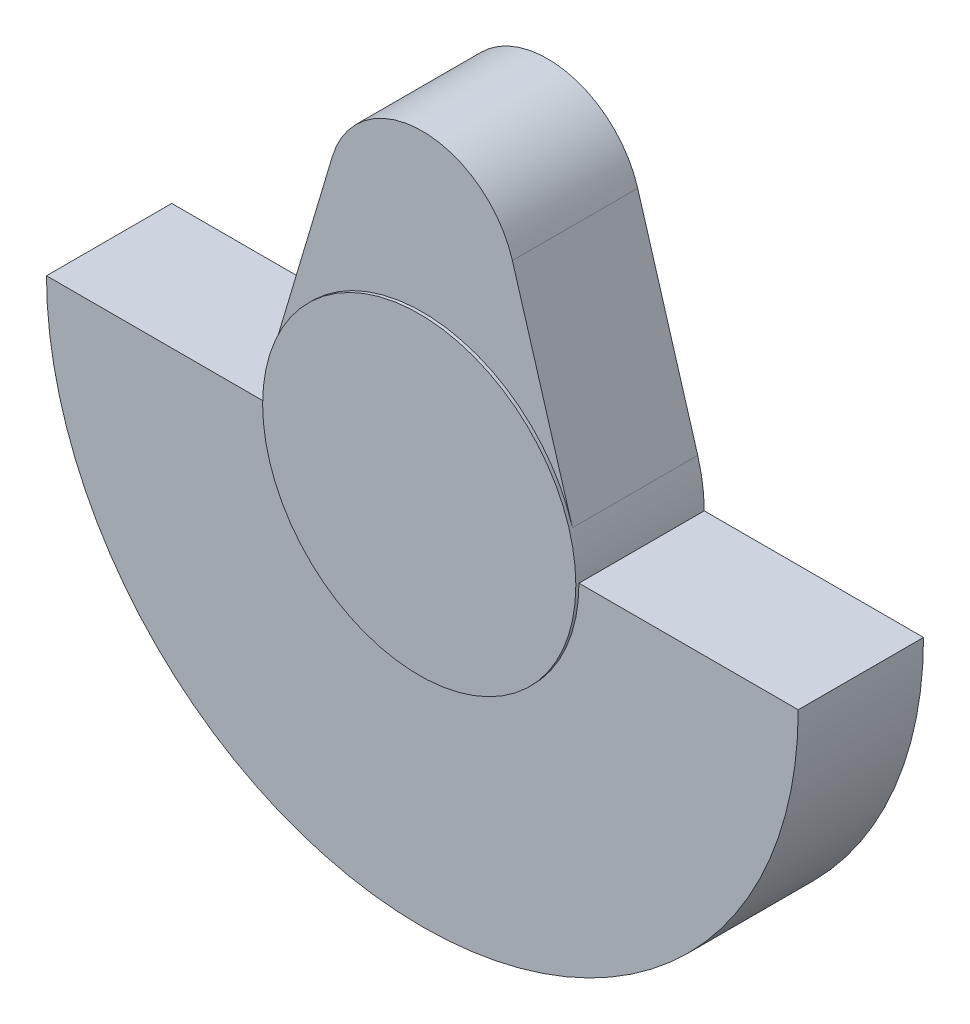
ISO-10303-21;
HEADER;
FILE_DESCRIPTION(('STEP AP214'),'2;1');
FILE_NAME('part.step','',(''),(''),'','','');
FILE_SCHEMA(('AUTOMOTIVE_DESIGN { 1 0 10303 214 1 1 1 1 }'));
ENDSEC;
DATA;
#1=APPLICATION_CONTEXT('core data for automotive mechanical design processes');
#2=APPLICATION_PROTOCOL_DEFINITION('international standard','automotive_design',2000,#1);
#3=PRODUCT_CONTEXT('',#1,'mechanical');
#4=PRODUCT('Part','Part','',(#3));
#5=PRODUCT_RELATED_PRODUCT_CATEGORY('part','',(#4));
#6=PRODUCT_DEFINITION_FORMATION('','',#4);
#7=PRODUCT_DEFINITION_CONTEXT('part definition',#1,'design');
#8=PRODUCT_DEFINITION('design','',#6,#7);
#9=PRODUCT_DEFINITION_SHAPE('','',#8);
#10=(LENGTH_UNIT() NAMED_UNIT(*) SI_UNIT(.MILLI.,.METRE.));
#11=(NAMED_UNIT(*) PLANE_ANGLE_UNIT() SI_UNIT($,.RADIAN.));
#12=(NAMED_UNIT(*) SI_UNIT($,.STERADIAN.) SOLID_ANGLE_UNIT());
#13=UNCERTAINTY_MEASURE_WITH_UNIT(LENGTH_MEASURE(1.E-05),#10,'distance_accuracy_value','');
#14=(GEOMETRIC_REPRESENTATION_CONTEXT(3) GLOBAL_UNCERTAINTY_ASSIGNED_CONTEXT((#13)) GLOBAL_UNIT_ASSIGNED_CONTEXT((#10,
#11,#12)) REPRESENTATION_CONTEXT('',''));
#15=CARTESIAN_POINT('',(0.,0.,0.));
#16=DIRECTION('',(0.,0.,1.));
#17=DIRECTION('',(1.,0.,0.));
#18=AXIS2_PLACEMENT_3D('',#15,#16,#17);
#19=CARTESIAN_POINT('',(0.,0.,-40.));
#20=DIRECTION('',(0.,0.,1.));
#21=DIRECTION('',(1.,0.,0.));
#22=AXIS2_PLACEMENT_3D('',#19,#20,#21);
#23=CYLINDRICAL_SURFACE('',#22,50.);
#24=DIRECTION('',(0.,0.,1.));
#25=VECTOR('',#24,1.);
#26=CARTESIAN_POINT('',(47.9157423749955,14.2857142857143,-308.328157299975));
#27=LINE('',#26,#25);
#28=CARTESIAN_POINT('',(47.9157423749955,14.2857142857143,-40.));
#29=VERTEX_POINT('',#28);
#30=CARTESIAN_POINT('',(47.9157423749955,14.2857142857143,0.));
#31=VERTEX_POINT('',#30);
#32=EDGE_CURVE('E48',#29,#31,#27,.T.);
#33=ORIENTED_EDGE('',*,*,#32,.T.);
#34=CARTESIAN_POINT('',(0.,0.,0.));
#35=DIRECTION('',(0.,0.,1.));
#36=DIRECTION('',(1.,0.,0.));
#37=AXIS2_PLACEMENT_3D('',#34,#35,#36);
#38=CIRCLE('',#37,50.);
#39=CARTESIAN_POINT('',(-47.9157423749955,14.2857142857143,0.));
#40=VERTEX_POINT('',#39);
#41=EDGE_CURVE('E53',#31,#40,#38,.T.);
#42=ORIENTED_EDGE('',*,*,#41,.T.);
#43=DIRECTION('',(0.,0.,1.));
#44=VECTOR('',#43,1.);
#45=CARTESIAN_POINT('',(-47.9157423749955,14.2857142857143,-308.328157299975));
#46=LINE('',#45,#44);
#47=CARTESIAN_POINT('',(-47.9157423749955,14.2857142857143,-40.));
#48=VERTEX_POINT('',#47);
#49=EDGE_CURVE('E108',#48,#40,#46,.T.);
#50=ORIENTED_EDGE('',*,*,#49,.F.);
#51=CARTESIAN_POINT('',(0.,0.,-40.));
#52=DIRECTION('',(0.,0.,1.));
#53=DIRECTION('',(1.,0.,0.));
#54=AXIS2_PLACEMENT_3D('',#51,#52,#53);
#55=CIRCLE('',#54,50.);
#56=CARTESIAN_POINT('',(-50.,0.,-40.));
#57=VERTEX_POINT('',#56);
#58=EDGE_CURVE('E42',#48,#57,#55,.T.);
#59=ORIENTED_EDGE('',*,*,#58,.T.);
#60=DIRECTION('',(0.,0.,1.));
#61=VECTOR('',#60,1.);
#62=CARTESIAN_POINT('',(-50.,0.,-308.328157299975));
#63=LINE('',#62,#61);
#64=CARTESIAN_POINT('',(-50.,0.,0.));
#65=VERTEX_POINT('',#64);
#66=EDGE_CURVE('E151',#57,#65,#63,.T.);
#67=ORIENTED_EDGE('',*,*,#66,.T.);
#68=CARTESIAN_POINT('',(0.,0.,0.));
#69=DIRECTION('',(0.,0.,1.));
#70=DIRECTION('',(1.,0.,0.));
#71=AXIS2_PLACEMENT_3D('',#68,#69,#70);
#72=CIRCLE('',#71,50.);
#73=CARTESIAN_POINT('',(50.,0.,0.));
#74=VERTEX_POINT('',#73);
#75=EDGE_CURVE('E144',#65,#74,#72,.T.);
#76=ORIENTED_EDGE('',*,*,#75,.T.);
#77=DIRECTION('',(0.,0.,1.));
#78=VECTOR('',#77,1.);
#79=CARTESIAN_POINT('',(50.,0.,-308.328157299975));
#80=LINE('',#79,#78);
#81=CARTESIAN_POINT('',(50.,0.,-40.));
#82=VERTEX_POINT('',#81);
#83=EDGE_CURVE('E153',#82,#74,#80,.T.);
#84=ORIENTED_EDGE('',*,*,#83,.F.);
#85=EDGE_CURVE('E11',#82,#29,#55,.T.);
#86=ORIENTED_EDGE('',*,*,#85,.T.);
#87=EDGE_LOOP('',(#33,#42,#50,#59,#67,#76,#84,#86));
#88=FACE_BOUND('',#87,.T.);
#89=CARTESIAN_POINT('',(0.,0.,1.));
#90=DIRECTION('',(0.,0.,1.));
#91=DIRECTION('',(1.,0.,0.));
#92=AXIS2_PLACEMENT_3D('',#89,#90,#91);
#93=CIRCLE('',#92,50.);
#94=CARTESIAN_POINT('',(50.,0.,1.));
#95=VERTEX_POINT('',#94);
#96=EDGE_CURVE('E157',#95,#95,#93,.T.);
#97=ORIENTED_EDGE('',*,*,#96,.F.);
#98=EDGE_LOOP('',(#97));
#99=FACE_BOUND('',#98,.T.);
#100=ADVANCED_FACE('F35',(#88,#99),#23,.T.);
#101=CARTESIAN_POINT('',(0.,0.,-40.));
#102=DIRECTION('',(0.,0.,1.));
#103=DIRECTION('',(1.,0.,0.));
#104=AXIS2_PLACEMENT_3D('',#101,#102,#103);
#105=PLANE('',#104);
#106=ORIENTED_EDGE('',*,*,#85,.F.);
#107=DIRECTION('',(1.,0.,0.));
#108=VECTOR('',#107,1.);
#109=CARTESIAN_POINT('',(0.,0.,-40.));
#110=LINE('',#109,#108);
#111=CARTESIAN_POINT('',(120.,0.,-40.));
#112=VERTEX_POINT('',#111);
#113=EDGE_CURVE('E138',#82,#112,#110,.T.);
#114=ORIENTED_EDGE('',*,*,#113,.T.);
#115=CARTESIAN_POINT('',(0.,0.,-40.));
#116=DIRECTION('',(0.,0.,1.));
#117=DIRECTION('',(1.,0.,0.));
#118=AXIS2_PLACEMENT_3D('',#115,#116,#117);
#119=CIRCLE('',#118,120.);
#120=CARTESIAN_POINT('',(-120.,0.,-40.));
#121=VERTEX_POINT('',#120);
#122=EDGE_CURVE('E134',#121,#112,#119,.T.);
#123=ORIENTED_EDGE('',*,*,#122,.F.);
#124=DIRECTION('',(-1.,0.,0.));
#125=VECTOR('',#124,1.);
#126=CARTESIAN_POINT('',(0.,0.,-40.));
#127=LINE('',#126,#125);
#128=EDGE_CURVE('E131',#57,#121,#127,.T.);
#129=ORIENTED_EDGE('',*,*,#128,.F.);
#130=ORIENTED_EDGE('',*,*,#58,.F.);
#131=DIRECTION('',(0.285714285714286,0.95831484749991,0.));
#132=VECTOR('',#131,1.);
#133=CARTESIAN_POINT('',(-47.9157423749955,14.2857142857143,-40.));
#134=LINE('',#133,#132);
#135=CARTESIAN_POINT('',(-28.7494454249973,78.5714285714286,-40.));
#136=VERTEX_POINT('',#135);
#137=EDGE_CURVE('E128',#48,#136,#134,.T.);
#138=ORIENTED_EDGE('',*,*,#137,.T.);
#139=CARTESIAN_POINT('',(0.,70.,-40.));
#140=DIRECTION('',(0.,0.,1.));
#141=DIRECTION('',(1.,0.,0.));
#142=AXIS2_PLACEMENT_3D('',#139,#140,#141);
#143=CIRCLE('',#142,30.);
#144=CARTESIAN_POINT('',(28.7494454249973,78.5714285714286,-40.));
#145=VERTEX_POINT('',#144);
#146=EDGE_CURVE('E104',#145,#136,#143,.T.);
#147=ORIENTED_EDGE('',*,*,#146,.F.);
#148=DIRECTION('',(-0.285714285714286,0.95831484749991,0.));
#149=VECTOR('',#148,1.);
#150=CARTESIAN_POINT('',(47.9157423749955,14.2857142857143,-40.));
#151=LINE('',#150,#149);
#152=EDGE_CURVE('E125',#29,#145,#151,.T.);
#153=ORIENTED_EDGE('',*,*,#152,.F.);
#154=EDGE_LOOP('',(#106,#114,#123,#129,#130,#138,#147,#153));
#155=FACE_BOUND('',#154,.T.);
#156=ADVANCED_FACE('F165',(#155),#105,.F.);
#157=CARTESIAN_POINT('',(0.,0.,1.));
#158=DIRECTION('',(0.,0.,1.));
#159=DIRECTION('',(1.,0.,0.));
#160=AXIS2_PLACEMENT_3D('',#157,#158,#159);
#161=PLANE('',#160);
#162=ORIENTED_EDGE('',*,*,#96,.T.);
#163=EDGE_LOOP('',(#162));
#164=FACE_BOUND('',#163,.T.);
#165=ADVANCED_FACE('F184',(#164),#161,.T.);
#166=CARTESIAN_POINT('',(0.,0.,-308.328157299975));
#167=DIRECTION('',(0.,0.,1.));
#168=DIRECTION('',(1.,0.,0.));
#169=AXIS2_PLACEMENT_3D('',#166,#167,#168);
#170=CYLINDRICAL_SURFACE('',#169,120.);
#171=DIRECTION('',(0.,0.,1.));
#172=VECTOR('',#171,1.);
#173=CARTESIAN_POINT('',(-120.,0.,-308.328157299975));
#174=LINE('',#173,#172);
#175=CARTESIAN_POINT('',(-120.,0.,0.));
#176=VERTEX_POINT('',#175);
#177=EDGE_CURVE('E135',#121,#176,#174,.T.);
#178=ORIENTED_EDGE('',*,*,#177,.F.);
#179=ORIENTED_EDGE('',*,*,#122,.T.);
#180=DIRECTION('',(0.,0.,1.));
#181=VECTOR('',#180,1.);
#182=CARTESIAN_POINT('',(120.,0.,-308.328157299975));
#183=LINE('',#182,#181);
#184=CARTESIAN_POINT('',(120.,0.,0.));
#185=VERTEX_POINT('',#184);
#186=EDGE_CURVE('E149',#112,#185,#183,.T.);
#187=ORIENTED_EDGE('',*,*,#186,.T.);
#188=CARTESIAN_POINT('',(0.,0.,0.));
#189=DIRECTION('',(0.,0.,1.));
#190=DIRECTION('',(1.,0.,0.));
#191=AXIS2_PLACEMENT_3D('',#188,#189,#190);
#192=CIRCLE('',#191,120.);
#193=EDGE_CURVE('E130',#185,#176,#192,.F.);
#194=ORIENTED_EDGE('',*,*,#193,.T.);
#195=EDGE_LOOP('',(#178,#179,#187,#194));
#196=FACE_BOUND('',#195,.T.);
#197=ADVANCED_FACE('F182',(#196),#170,.T.);
#198=CARTESIAN_POINT('',(0.,0.,-308.328157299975));
#199=DIRECTION('',(0.,-1.,0.));
#200=DIRECTION('',(0.,0.,-1.));
#201=AXIS2_PLACEMENT_3D('',#198,#199,#200);
#202=PLANE('',#201);
#203=ORIENTED_EDGE('',*,*,#66,.F.);
#204=ORIENTED_EDGE('',*,*,#128,.T.);
#205=ORIENTED_EDGE('',*,*,#177,.T.);
#206=DIRECTION('',(1.,0.,0.));
#207=VECTOR('',#206,1.);
#208=CARTESIAN_POINT('',(0.,0.,0.));
#209=LINE('',#208,#207);
#210=EDGE_CURVE('E146',#176,#65,#209,.T.);
#211=ORIENTED_EDGE('',*,*,#210,.T.);
#212=EDGE_LOOP('',(#203,#204,#205,#211));
#213=FACE_BOUND('',#212,.T.);
#214=ADVANCED_FACE('F168',(#213),#202,.F.);
#215=CARTESIAN_POINT('',(0.,0.,-308.328157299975));
#216=DIRECTION('',(0.,1.,0.));
#217=DIRECTION('',(0.,0.,1.));
#218=AXIS2_PLACEMENT_3D('',#215,#216,#217);
#219=PLANE('',#218);
#220=ORIENTED_EDGE('',*,*,#113,.F.);
#221=ORIENTED_EDGE('',*,*,#83,.T.);
#222=DIRECTION('',(-1.,0.,0.));
#223=VECTOR('',#222,1.);
#224=CARTESIAN_POINT('',(0.,0.,0.));
#225=LINE('',#224,#223);
#226=EDGE_CURVE('E141',#185,#74,#225,.T.);
#227=ORIENTED_EDGE('',*,*,#226,.F.);
#228=ORIENTED_EDGE('',*,*,#186,.F.);
#229=EDGE_LOOP('',(#220,#221,#227,#228));
#230=FACE_BOUND('',#229,.T.);
#231=ADVANCED_FACE('F178',(#230),#219,.T.);
#232=CARTESIAN_POINT('',(0.,0.,0.));
#233=DIRECTION('',(0.,0.,1.));
#234=DIRECTION('',(1.,0.,0.));
#235=AXIS2_PLACEMENT_3D('',#232,#233,#234);
#236=PLANE('',#235);
#237=ORIENTED_EDGE('',*,*,#193,.F.);
#238=ORIENTED_EDGE('',*,*,#226,.T.);
#239=ORIENTED_EDGE('',*,*,#75,.F.);
#240=ORIENTED_EDGE('',*,*,#210,.F.);
#241=EDGE_LOOP('',(#237,#238,#239,#240));
#242=FACE_BOUND('',#241,.T.);
#243=ADVANCED_FACE('F173',(#242),#236,.T.);
#244=CARTESIAN_POINT('',(0.,70.,-308.328157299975));
#245=DIRECTION('',(0.,0.,1.));
#246=DIRECTION('',(1.,0.,0.));
#247=AXIS2_PLACEMENT_3D('',#244,#245,#246);
#248=CYLINDRICAL_SURFACE('',#247,30.);
#249=DIRECTION('',(0.,0.,1.));
#250=VECTOR('',#249,1.);
#251=CARTESIAN_POINT('',(28.7494454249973,78.5714285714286,-308.328157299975));
#252=LINE('',#251,#250);
#253=CARTESIAN_POINT('',(28.7494454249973,78.5714285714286,0.));
#254=VERTEX_POINT('',#253);
#255=EDGE_CURVE('E123',#145,#254,#252,.T.);
#256=ORIENTED_EDGE('',*,*,#255,.F.);
#257=ORIENTED_EDGE('',*,*,#146,.T.);
#258=DIRECTION('',(0.,0.,1.));
#259=VECTOR('',#258,1.);
#260=CARTESIAN_POINT('',(-28.7494454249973,78.5714285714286,-308.328157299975));
#261=LINE('',#260,#259);
#262=CARTESIAN_POINT('',(-28.7494454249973,78.5714285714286,0.));
#263=VERTEX_POINT('',#262);
#264=EDGE_CURVE('E99',#136,#263,#261,.T.);
#265=ORIENTED_EDGE('',*,*,#264,.T.);
#266=CARTESIAN_POINT('',(0.,70.,0.));
#267=DIRECTION('',(0.,0.,1.));
#268=DIRECTION('',(1.,0.,0.));
#269=AXIS2_PLACEMENT_3D('',#266,#267,#268);
#270=CIRCLE('',#269,30.);
#271=EDGE_CURVE('E103',#263,#254,#270,.F.);
#272=ORIENTED_EDGE('',*,*,#271,.T.);
#273=EDGE_LOOP('',(#256,#257,#265,#272));
#274=FACE_BOUND('',#273,.T.);
#275=ADVANCED_FACE('F102',(#274),#248,.T.);
#276=CARTESIAN_POINT('',(47.9157423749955,14.2857142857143,-308.328157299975));
#277=DIRECTION('',(-0.95831484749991,-0.285714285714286,0.));
#278=DIRECTION('',(0.285714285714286,-0.95831484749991,0.));
#279=AXIS2_PLACEMENT_3D('',#276,#277,#278);
#280=PLANE('',#279);
#281=ORIENTED_EDGE('',*,*,#32,.F.);
#282=ORIENTED_EDGE('',*,*,#152,.T.);
#283=ORIENTED_EDGE('',*,*,#255,.T.);
#284=DIRECTION('',(0.285714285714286,-0.95831484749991,0.));
#285=VECTOR('',#284,1.);
#286=CARTESIAN_POINT('',(47.9157423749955,14.2857142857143,0.));
#287=LINE('',#286,#285);
#288=EDGE_CURVE('E109',#254,#31,#287,.T.);
#289=ORIENTED_EDGE('',*,*,#288,.T.);
#290=EDGE_LOOP('',(#281,#282,#283,#289));
#291=FACE_BOUND('',#290,.T.);
#292=ADVANCED_FACE('F247',(#291),#280,.F.);
#293=CARTESIAN_POINT('',(-47.9157423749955,14.2857142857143,-308.328157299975));
#294=DIRECTION('',(-0.95831484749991,0.285714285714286,0.));
#295=DIRECTION('',(-0.285714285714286,-0.95831484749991,0.));
#296=AXIS2_PLACEMENT_3D('',#293,#294,#295);
#297=PLANE('',#296);
#298=ORIENTED_EDGE('',*,*,#137,.F.);
#299=ORIENTED_EDGE('',*,*,#49,.T.);
#300=DIRECTION('',(-0.285714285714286,-0.95831484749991,0.));
#301=VECTOR('',#300,1.);
#302=CARTESIAN_POINT('',(-47.9157423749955,14.2857142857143,0.));
#303=LINE('',#302,#301);
#304=EDGE_CURVE('E115',#263,#40,#303,.T.);
#305=ORIENTED_EDGE('',*,*,#304,.F.);
#306=ORIENTED_EDGE('',*,*,#264,.F.);
#307=EDGE_LOOP('',(#298,#299,#305,#306));
#308=FACE_BOUND('',#307,.T.);
#309=ADVANCED_FACE('F117',(#308),#297,.T.);
#310=CARTESIAN_POINT('',(0.,0.,0.));
#311=DIRECTION('',(0.,0.,1.));
#312=DIRECTION('',(1.,0.,0.));
#313=AXIS2_PLACEMENT_3D('',#310,#311,#312);
#314=PLANE('',#313);
#315=ORIENTED_EDGE('',*,*,#271,.F.);
#316=ORIENTED_EDGE('',*,*,#304,.T.);
#317=ORIENTED_EDGE('',*,*,#41,.F.);
#318=ORIENTED_EDGE('',*,*,#288,.F.);
#319=EDGE_LOOP('',(#315,#316,#317,#318));
#320=FACE_BOUND('',#319,.T.);
#321=ADVANCED_FACE('F114',(#320),#314,.T.);
#322=CLOSED_SHELL('',(#100,#156,#165,#197,#214,#231,#243,#275,#292,#309,#321));
#323=MANIFOLD_SOLID_BREP('B2',#322);
#324=ADVANCED_BREP_SHAPE_REPRESENTATION('',(#18,#323),#14);
#325=SHAPE_DEFINITION_REPRESENTATION(#9,#324);
ENDSEC;
END-ISO-10303-21;
